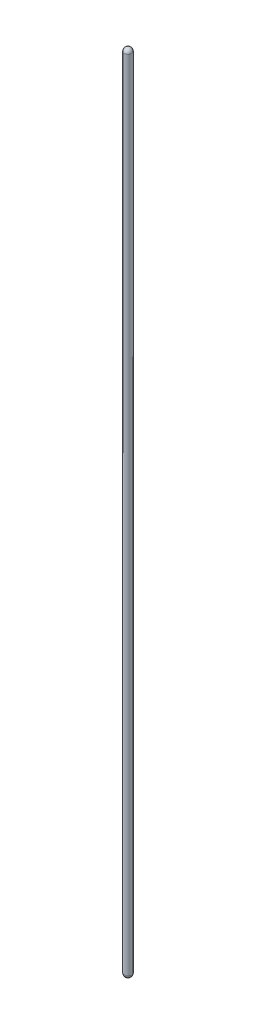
ISO-10303-21;
HEADER;
FILE_DESCRIPTION(('STEP AP214'),'2;1');
FILE_NAME('part.step','',(''),(''),'','','');
FILE_SCHEMA(('AUTOMOTIVE_DESIGN { 1 0 10303 214 1 1 1 1 }'));
ENDSEC;
DATA;
#1=APPLICATION_CONTEXT('core data for automotive mechanical design processes');
#2=APPLICATION_PROTOCOL_DEFINITION('international standard','automotive_design',2000,#1);
#3=PRODUCT_CONTEXT('',#1,'mechanical');
#4=PRODUCT('Part','Part','',(#3));
#5=PRODUCT_RELATED_PRODUCT_CATEGORY('part','',(#4));
#6=PRODUCT_DEFINITION_FORMATION('','',#4);
#7=PRODUCT_DEFINITION_CONTEXT('part definition',#1,'design');
#8=PRODUCT_DEFINITION('design','',#6,#7);
#9=PRODUCT_DEFINITION_SHAPE('','',#8);
#10=(LENGTH_UNIT() NAMED_UNIT(*) SI_UNIT(.MILLI.,.METRE.));
#11=(NAMED_UNIT(*) PLANE_ANGLE_UNIT() SI_UNIT($,.RADIAN.));
#12=(NAMED_UNIT(*) SI_UNIT($,.STERADIAN.) SOLID_ANGLE_UNIT());
#13=UNCERTAINTY_MEASURE_WITH_UNIT(LENGTH_MEASURE(1.E-05),#10,'distance_accuracy_value','');
#14=(GEOMETRIC_REPRESENTATION_CONTEXT(3) GLOBAL_UNCERTAINTY_ASSIGNED_CONTEXT((#13)) GLOBAL_UNIT_ASSIGNED_CONTEXT((#10,
#11,#12)) REPRESENTATION_CONTEXT('',''));
#15=CARTESIAN_POINT('',(0.,0.,0.));
#16=DIRECTION('',(0.,0.,1.));
#17=DIRECTION('',(1.,0.,0.));
#18=AXIS2_PLACEMENT_3D('',#15,#16,#17);
#19=CARTESIAN_POINT('',(0.,-167.9575,0.));
#20=DIRECTION('',(0.,1.,0.));
#21=DIRECTION('',(0.,0.,1.));
#22=AXIS2_PLACEMENT_3D('',#19,#20,#21);
#23=CYLINDRICAL_SURFACE('',#22,1.5875);
#24=CARTESIAN_POINT('',(0.,-167.9575,0.));
#25=DIRECTION('',(0.,1.,0.));
#26=DIRECTION('',(0.,0.,1.));
#27=AXIS2_PLACEMENT_3D('',#24,#25,#26);
#28=CIRCLE('',#27,1.5875);
#29=CARTESIAN_POINT('',(0.,-167.9575,1.5875));
#30=VERTEX_POINT('',#29);
#31=EDGE_CURVE('E10',#30,#30,#28,.T.);
#32=ORIENTED_EDGE('',*,*,#31,.T.);
#33=EDGE_LOOP('',(#32));
#34=FACE_BOUND('',#33,.T.);
#35=CARTESIAN_POINT('',(0.,167.9575,0.));
#36=DIRECTION('',(0.,1.,0.));
#37=DIRECTION('',(0.,0.,1.));
#38=AXIS2_PLACEMENT_3D('',#35,#36,#37);
#39=CIRCLE('',#38,1.5875);
#40=CARTESIAN_POINT('',(0.,167.9575,1.5875));
#41=VERTEX_POINT('',#40);
#42=EDGE_CURVE('E359',#41,#41,#39,.T.);
#43=ORIENTED_EDGE('',*,*,#42,.F.);
#44=EDGE_LOOP('',(#43));
#45=FACE_BOUND('',#44,.T.);
#46=ADVANCED_FACE('F352',(#34,#45),#23,.T.);
#47=CARTESIAN_POINT('',(0.,-167.9575,0.));
#48=DIRECTION('',(0.,0.,1.));
#49=DIRECTION('',(1.,0.,0.));
#50=AXIS2_PLACEMENT_3D('',#47,#48,#49);
#51=SPHERICAL_SURFACE('',#50,1.5875);
#52=CARTESIAN_POINT('',(0.,-167.9575,0.));
#53=DIRECTION('',(0.,1.,0.));
#54=DIRECTION('',(0.,0.,1.));
#55=AXIS2_PLACEMENT_3D('',#52,#53,#54);
#56=SPHERICAL_SURFACE('',#55,1.5875);
#57=ORIENTED_EDGE('',*,*,#31,.F.);
#58=EDGE_LOOP('',(#57));
#59=FACE_BOUND('',#58,.T.);
#60=ADVANCED_FACE('F367',(#59),#56,.T.);
#61=CARTESIAN_POINT('',(0.,167.9575,0.));
#62=DIRECTION('',(0.,0.,1.));
#63=DIRECTION('',(1.,0.,0.));
#64=AXIS2_PLACEMENT_3D('',#61,#62,#63);
#65=SPHERICAL_SURFACE('',#64,1.5875);
#66=CARTESIAN_POINT('',(0.,167.9575,0.));
#67=DIRECTION('',(0.,1.,0.));
#68=DIRECTION('',(0.,0.,1.));
#69=AXIS2_PLACEMENT_3D('',#66,#67,#68);
#70=SPHERICAL_SURFACE('',#69,1.5875);
#71=ORIENTED_EDGE('',*,*,#42,.T.);
#72=EDGE_LOOP('',(#71));
#73=FACE_BOUND('',#72,.T.);
#74=ADVANCED_FACE('F354',(#73),#70,.T.);
#75=CLOSED_SHELL('',(#46,#60,#74));
#76=MANIFOLD_SOLID_BREP('B2',#75);
#77=ADVANCED_BREP_SHAPE_REPRESENTATION('',(#18,#76),#14);
#78=SHAPE_DEFINITION_REPRESENTATION(#9,#77);
ENDSEC;
END-ISO-10303-21;
